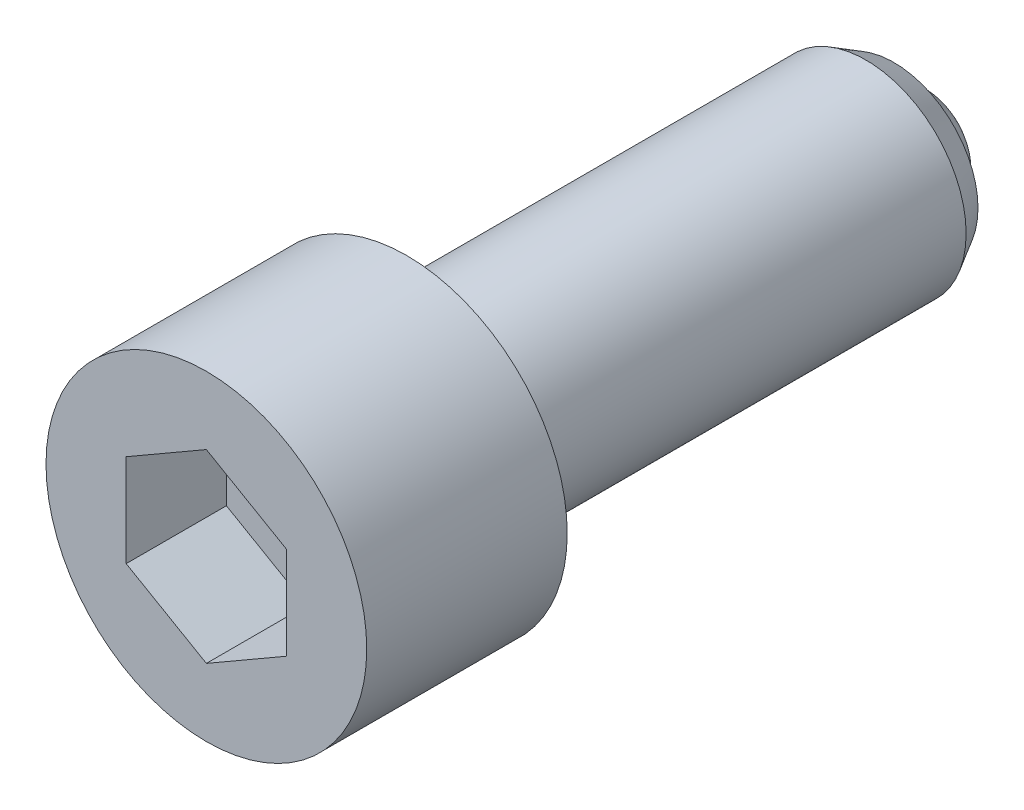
ISO-10303-21;
HEADER;
FILE_DESCRIPTION(('STEP AP214'),'2;1');
FILE_NAME('part.step','',(''),(''),'','','');
FILE_SCHEMA(('AUTOMOTIVE_DESIGN { 1 0 10303 214 1 1 1 1 }'));
ENDSEC;
DATA;
#1=APPLICATION_CONTEXT('core data for automotive mechanical design processes');
#2=APPLICATION_PROTOCOL_DEFINITION('international standard','automotive_design',2000,#1);
#3=PRODUCT_CONTEXT('',#1,'mechanical');
#4=PRODUCT('Part','Part','',(#3));
#5=PRODUCT_RELATED_PRODUCT_CATEGORY('part','',(#4));
#6=PRODUCT_DEFINITION_FORMATION('','',#4);
#7=PRODUCT_DEFINITION_CONTEXT('part definition',#1,'design');
#8=PRODUCT_DEFINITION('design','',#6,#7);
#9=PRODUCT_DEFINITION_SHAPE('','',#8);
#10=(LENGTH_UNIT() NAMED_UNIT(*) SI_UNIT(.MILLI.,.METRE.));
#11=(NAMED_UNIT(*) PLANE_ANGLE_UNIT() SI_UNIT($,.RADIAN.));
#12=(NAMED_UNIT(*) SI_UNIT($,.STERADIAN.) SOLID_ANGLE_UNIT());
#13=UNCERTAINTY_MEASURE_WITH_UNIT(LENGTH_MEASURE(1.E-05),#10,'distance_accuracy_value','');
#14=(GEOMETRIC_REPRESENTATION_CONTEXT(3) GLOBAL_UNCERTAINTY_ASSIGNED_CONTEXT((#13)) GLOBAL_UNIT_ASSIGNED_CONTEXT((#10,
#11,#12)) REPRESENTATION_CONTEXT('',''));
#15=CARTESIAN_POINT('',(0.,0.,0.));
#16=DIRECTION('',(0.,0.,1.));
#17=DIRECTION('',(1.,0.,0.));
#18=AXIS2_PLACEMENT_3D('',#15,#16,#17);
#19=CARTESIAN_POINT('',(0.,0.,3.5));
#20=DIRECTION('',(0.,0.,-1.));
#21=DIRECTION('',(1.,0.,0.));
#22=AXIS2_PLACEMENT_3D('',#19,#20,#21);
#23=SPHERICAL_SURFACE('',#22,3.5);
#24=CARTESIAN_POINT('',(0.,0.,2.4));
#25=DIRECTION('',(0.,0.,-1.));
#26=DIRECTION('',(1.,0.,0.));
#27=AXIS2_PLACEMENT_3D('',#24,#25,#26);
#28=CIRCLE('',#27,3.32264954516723);
#29=CARTESIAN_POINT('',(3.32264954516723,0.,2.4));
#30=VERTEX_POINT('',#29);
#31=EDGE_CURVE('E9',#30,#30,#28,.T.);
#32=ORIENTED_EDGE('',*,*,#31,.T.);
#33=EDGE_LOOP('',(#32));
#34=FACE_BOUND('',#33,.T.);
#35=ADVANCED_FACE('F15',(#34),#23,.T.);
#36=CARTESIAN_POINT('',(4.19170962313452,0.,2.4));
#37=DIRECTION('',(0.,0.,1.));
#38=DIRECTION('',(-1.,0.,0.));
#39=AXIS2_PLACEMENT_3D('',#36,#37,#38);
#40=PLANE('',#39);
#41=ORIENTED_EDGE('',*,*,#31,.F.);
#42=EDGE_LOOP('',(#41));
#43=FACE_BOUND('',#42,.T.);
#44=CARTESIAN_POINT('',(0.,0.,2.4));
#45=DIRECTION('',(0.,0.,-1.));
#46=DIRECTION('',(1.,0.,0.));
#47=AXIS2_PLACEMENT_3D('',#44,#45,#46);
#48=CIRCLE('',#47,4.19170962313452);
#49=CARTESIAN_POINT('',(4.19170962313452,0.,2.4));
#50=VERTEX_POINT('',#49);
#51=EDGE_CURVE('E22',#50,#50,#48,.T.);
#52=ORIENTED_EDGE('',*,*,#51,.T.);
#53=EDGE_LOOP('',(#52));
#54=FACE_BOUND('',#53,.T.);
#55=ADVANCED_FACE('F136',(#43,#54),#40,.F.);
#56=CARTESIAN_POINT('',(0.,0.,3.8));
#57=DIRECTION('',(0.,0.,1.));
#58=DIRECTION('',(-1.,0.,0.));
#59=AXIS2_PLACEMENT_3D('',#56,#57,#58);
#60=CONICAL_SURFACE('',#59,5.,0.523598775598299);
#61=ORIENTED_EDGE('',*,*,#51,.F.);
#62=EDGE_LOOP('',(#61));
#63=FACE_BOUND('',#62,.T.);
#64=CARTESIAN_POINT('',(0.,0.,3.8));
#65=DIRECTION('',(0.,0.,-1.));
#66=DIRECTION('',(1.,0.,0.));
#67=AXIS2_PLACEMENT_3D('',#64,#65,#66);
#68=CIRCLE('',#67,5.);
#69=CARTESIAN_POINT('',(5.,0.,3.8));
#70=VERTEX_POINT('',#69);
#71=EDGE_CURVE('E131',#70,#70,#68,.T.);
#72=ORIENTED_EDGE('',*,*,#71,.T.);
#73=EDGE_LOOP('',(#72));
#74=FACE_BOUND('',#73,.T.);
#75=ADVANCED_FACE('F138',(#63,#74),#60,.T.);
#76=CARTESIAN_POINT('',(0.,0.,-13.3));
#77=DIRECTION('',(0.,0.,-1.));
#78=DIRECTION('',(1.,0.,0.));
#79=AXIS2_PLACEMENT_3D('',#76,#77,#78);
#80=CYLINDRICAL_SURFACE('',#79,5.);
#81=ORIENTED_EDGE('',*,*,#71,.F.);
#82=EDGE_LOOP('',(#81));
#83=FACE_BOUND('',#82,.T.);
#84=CARTESIAN_POINT('',(0.,0.,26.7));
#85=DIRECTION('',(0.,0.,-1.));
#86=DIRECTION('',(1.,0.,0.));
#87=AXIS2_PLACEMENT_3D('',#84,#85,#86);
#88=CIRCLE('',#87,5.);
#89=CARTESIAN_POINT('',(5.,0.,26.7));
#90=VERTEX_POINT('',#89);
#91=EDGE_CURVE('E128',#90,#90,#88,.T.);
#92=ORIENTED_EDGE('',*,*,#91,.T.);
#93=EDGE_LOOP('',(#92));
#94=FACE_BOUND('',#93,.T.);
#95=ADVANCED_FACE('F141',(#83,#94),#80,.T.);
#96=CARTESIAN_POINT('',(5.,0.,26.7));
#97=DIRECTION('',(0.,0.,-1.));
#98=DIRECTION('',(1.,0.,0.));
#99=AXIS2_PLACEMENT_3D('',#96,#97,#98);
#100=PLANE('',#99);
#101=CARTESIAN_POINT('',(0.,0.,26.7));
#102=DIRECTION('',(0.,0.,-1.));
#103=DIRECTION('',(1.,0.,0.));
#104=AXIS2_PLACEMENT_3D('',#101,#102,#103);
#105=CIRCLE('',#104,8.);
#106=CARTESIAN_POINT('',(8.,0.,26.7));
#107=VERTEX_POINT('',#106);
#108=EDGE_CURVE('E125',#107,#107,#105,.T.);
#109=ORIENTED_EDGE('',*,*,#108,.T.);
#110=EDGE_LOOP('',(#109));
#111=FACE_BOUND('',#110,.T.);
#112=ORIENTED_EDGE('',*,*,#91,.F.);
#113=EDGE_LOOP('',(#112));
#114=FACE_BOUND('',#113,.T.);
#115=ADVANCED_FACE('F147',(#111,#114),#100,.T.);
#116=CARTESIAN_POINT('',(0.,0.,-13.3));
#117=DIRECTION('',(0.,0.,-1.));
#118=DIRECTION('',(1.,0.,0.));
#119=AXIS2_PLACEMENT_3D('',#116,#117,#118);
#120=CYLINDRICAL_SURFACE('',#119,8.);
#121=CARTESIAN_POINT('',(0.,0.,36.7));
#122=DIRECTION('',(0.,0.,-1.));
#123=DIRECTION('',(1.,0.,0.));
#124=AXIS2_PLACEMENT_3D('',#121,#122,#123);
#125=CIRCLE('',#124,8.);
#126=CARTESIAN_POINT('',(8.,0.,36.7));
#127=VERTEX_POINT('',#126);
#128=EDGE_CURVE('E122',#127,#127,#125,.T.);
#129=ORIENTED_EDGE('',*,*,#128,.T.);
#130=EDGE_LOOP('',(#129));
#131=FACE_BOUND('',#130,.T.);
#132=ORIENTED_EDGE('',*,*,#108,.F.);
#133=EDGE_LOOP('',(#132));
#134=FACE_BOUND('',#133,.T.);
#135=ADVANCED_FACE('F152',(#131,#134),#120,.T.);
#136=CARTESIAN_POINT('',(8.,0.,36.7));
#137=DIRECTION('',(0.,0.,1.));
#138=DIRECTION('',(-1.,0.,0.));
#139=AXIS2_PLACEMENT_3D('',#136,#137,#138);
#140=PLANE('',#139);
#141=DIRECTION('',(-0.86602540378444,0.5,0.));
#142=VECTOR('',#141,1.);
#143=CARTESIAN_POINT('',(4.,2.30940107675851,36.7));
#144=LINE('',#143,#142);
#145=CARTESIAN_POINT('',(4.,2.30940107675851,36.7));
#146=VERTEX_POINT('',#145);
#147=CARTESIAN_POINT('',(0.,4.618802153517,36.7));
#148=VERTEX_POINT('',#147);
#149=EDGE_CURVE('E29',#146,#148,#144,.T.);
#150=ORIENTED_EDGE('',*,*,#149,.F.);
#151=DIRECTION('',(0.,1.,0.));
#152=VECTOR('',#151,1.);
#153=CARTESIAN_POINT('',(4.,-2.30940107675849,36.7));
#154=LINE('',#153,#152);
#155=CARTESIAN_POINT('',(4.,-2.30940107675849,36.7));
#156=VERTEX_POINT('',#155);
#157=EDGE_CURVE('E98',#156,#146,#154,.T.);
#158=ORIENTED_EDGE('',*,*,#157,.F.);
#159=DIRECTION('',(-0.866025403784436,-0.5,0.));
#160=VECTOR('',#159,1.);
#161=CARTESIAN_POINT('',(4.,-2.30940107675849,36.7));
#162=LINE('',#161,#160);
#163=CARTESIAN_POINT('',(0.,-4.61880215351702,36.7));
#164=VERTEX_POINT('',#163);
#165=EDGE_CURVE('E93',#156,#164,#162,.T.);
#166=ORIENTED_EDGE('',*,*,#165,.T.);
#167=DIRECTION('',(0.866025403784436,-0.5,0.));
#168=VECTOR('',#167,1.);
#169=CARTESIAN_POINT('',(-4.,-2.30940107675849,36.7));
#170=LINE('',#169,#168);
#171=CARTESIAN_POINT('',(-4.,-2.30940107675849,36.7));
#172=VERTEX_POINT('',#171);
#173=EDGE_CURVE('E91',#172,#164,#170,.T.);
#174=ORIENTED_EDGE('',*,*,#173,.F.);
#175=DIRECTION('',(0.,1.,0.));
#176=VECTOR('',#175,1.);
#177=CARTESIAN_POINT('',(-4.,-2.30940107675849,36.7));
#178=LINE('',#177,#176);
#179=CARTESIAN_POINT('',(-4.,2.30940107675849,36.7));
#180=VERTEX_POINT('',#179);
#181=EDGE_CURVE('E72',#172,#180,#178,.T.);
#182=ORIENTED_EDGE('',*,*,#181,.T.);
#183=DIRECTION('',(0.866025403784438,0.5,0.));
#184=VECTOR('',#183,1.);
#185=CARTESIAN_POINT('',(-4.,2.30940107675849,36.7));
#186=LINE('',#185,#184);
#187=EDGE_CURVE('E83',#180,#148,#186,.T.);
#188=ORIENTED_EDGE('',*,*,#187,.T.);
#189=EDGE_LOOP('',(#150,#158,#166,#174,#182,#188));
#190=FACE_BOUND('',#189,.T.);
#191=ORIENTED_EDGE('',*,*,#128,.F.);
#192=EDGE_LOOP('',(#191));
#193=FACE_BOUND('',#192,.T.);
#194=ADVANCED_FACE('F87',(#190,#193),#140,.T.);
#195=CARTESIAN_POINT('',(4.,2.30940107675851,31.7));
#196=DIRECTION('',(0.5,0.86602540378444,0.));
#197=DIRECTION('',(0.86602540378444,-0.5,0.));
#198=AXIS2_PLACEMENT_3D('',#195,#196,#197);
#199=PLANE('',#198);
#200=DIRECTION('',(0.,0.,1.));
#201=VECTOR('',#200,1.);
#202=CARTESIAN_POINT('',(4.,2.30940107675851,31.7));
#203=LINE('',#202,#201);
#204=CARTESIAN_POINT('',(4.,2.30940107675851,31.7));
#205=VERTEX_POINT('',#204);
#206=EDGE_CURVE('E36',#205,#146,#203,.T.);
#207=ORIENTED_EDGE('',*,*,#206,.T.);
#208=ORIENTED_EDGE('',*,*,#149,.T.);
#209=DIRECTION('',(0.,0.,1.));
#210=VECTOR('',#209,1.);
#211=CARTESIAN_POINT('',(0.,4.618802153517,31.7));
#212=LINE('',#211,#210);
#213=CARTESIAN_POINT('',(0.,4.618802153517,31.7));
#214=VERTEX_POINT('',#213);
#215=EDGE_CURVE('E80',#214,#148,#212,.T.);
#216=ORIENTED_EDGE('',*,*,#215,.F.);
#217=DIRECTION('',(-0.86602540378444,0.5,0.));
#218=VECTOR('',#217,1.);
#219=CARTESIAN_POINT('',(4.,2.30940107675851,31.7));
#220=LINE('',#219,#218);
#221=EDGE_CURVE('E100',#205,#214,#220,.T.);
#222=ORIENTED_EDGE('',*,*,#221,.F.);
#223=EDGE_LOOP('',(#207,#208,#216,#222));
#224=FACE_BOUND('',#223,.T.);
#225=ADVANCED_FACE('F206',(#224),#199,.F.);
#226=CARTESIAN_POINT('',(4.,-2.30940107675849,31.7));
#227=DIRECTION('',(1.,0.,0.));
#228=DIRECTION('',(0.,-1.,0.));
#229=AXIS2_PLACEMENT_3D('',#226,#227,#228);
#230=PLANE('',#229);
#231=DIRECTION('',(0.,0.,1.));
#232=VECTOR('',#231,1.);
#233=CARTESIAN_POINT('',(4.,-2.30940107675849,31.7));
#234=LINE('',#233,#232);
#235=CARTESIAN_POINT('',(4.,-2.30940107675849,31.7));
#236=VERTEX_POINT('',#235);
#237=EDGE_CURVE('E119',#236,#156,#234,.T.);
#238=ORIENTED_EDGE('',*,*,#237,.T.);
#239=ORIENTED_EDGE('',*,*,#157,.T.);
#240=ORIENTED_EDGE('',*,*,#206,.F.);
#241=DIRECTION('',(0.,1.,0.));
#242=VECTOR('',#241,1.);
#243=CARTESIAN_POINT('',(4.,-2.30940107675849,31.7));
#244=LINE('',#243,#242);
#245=EDGE_CURVE('E112',#236,#205,#244,.T.);
#246=ORIENTED_EDGE('',*,*,#245,.F.);
#247=EDGE_LOOP('',(#238,#239,#240,#246));
#248=FACE_BOUND('',#247,.T.);
#249=ADVANCED_FACE('F215',(#248),#230,.F.);
#250=CARTESIAN_POINT('',(4.,-2.30940107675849,31.7));
#251=DIRECTION('',(-0.5,0.866025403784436,0.));
#252=DIRECTION('',(0.866025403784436,0.5,0.));
#253=AXIS2_PLACEMENT_3D('',#250,#251,#252);
#254=PLANE('',#253);
#255=DIRECTION('',(0.,0.,1.));
#256=VECTOR('',#255,1.);
#257=CARTESIAN_POINT('',(0.,-4.61880215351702,31.7));
#258=LINE('',#257,#256);
#259=CARTESIAN_POINT('',(0.,-4.61880215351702,31.7));
#260=VERTEX_POINT('',#259);
#261=EDGE_CURVE('E117',#260,#164,#258,.T.);
#262=ORIENTED_EDGE('',*,*,#261,.T.);
#263=ORIENTED_EDGE('',*,*,#165,.F.);
#264=ORIENTED_EDGE('',*,*,#237,.F.);
#265=DIRECTION('',(-0.866025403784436,-0.5,0.));
#266=VECTOR('',#265,1.);
#267=CARTESIAN_POINT('',(4.,-2.30940107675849,31.7));
#268=LINE('',#267,#266);
#269=EDGE_CURVE('E109',#236,#260,#268,.T.);
#270=ORIENTED_EDGE('',*,*,#269,.T.);
#271=EDGE_LOOP('',(#262,#263,#264,#270));
#272=FACE_BOUND('',#271,.T.);
#273=ADVANCED_FACE('F224',(#272),#254,.T.);
#274=CARTESIAN_POINT('',(-4.,-2.30940107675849,31.7));
#275=DIRECTION('',(-0.5,-0.866025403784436,0.));
#276=DIRECTION('',(-0.866025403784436,0.5,0.));
#277=AXIS2_PLACEMENT_3D('',#274,#275,#276);
#278=PLANE('',#277);
#279=DIRECTION('',(0.,0.,1.));
#280=VECTOR('',#279,1.);
#281=CARTESIAN_POINT('',(-4.,-2.30940107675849,31.7));
#282=LINE('',#281,#280);
#283=CARTESIAN_POINT('',(-4.,-2.30940107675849,31.7));
#284=VERTEX_POINT('',#283);
#285=EDGE_CURVE('E79',#284,#172,#282,.T.);
#286=ORIENTED_EDGE('',*,*,#285,.T.);
#287=ORIENTED_EDGE('',*,*,#173,.T.);
#288=ORIENTED_EDGE('',*,*,#261,.F.);
#289=DIRECTION('',(0.866025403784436,-0.5,0.));
#290=VECTOR('',#289,1.);
#291=CARTESIAN_POINT('',(-4.,-2.30940107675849,31.7));
#292=LINE('',#291,#290);
#293=EDGE_CURVE('E106',#284,#260,#292,.T.);
#294=ORIENTED_EDGE('',*,*,#293,.F.);
#295=EDGE_LOOP('',(#286,#287,#288,#294));
#296=FACE_BOUND('',#295,.T.);
#297=ADVANCED_FACE('F233',(#296),#278,.F.);
#298=CARTESIAN_POINT('',(-4.,-2.30940107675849,31.7));
#299=DIRECTION('',(1.,0.,0.));
#300=DIRECTION('',(0.,-1.,0.));
#301=AXIS2_PLACEMENT_3D('',#298,#299,#300);
#302=PLANE('',#301);
#303=DIRECTION('',(0.,0.,1.));
#304=VECTOR('',#303,1.);
#305=CARTESIAN_POINT('',(-4.,2.30940107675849,31.7));
#306=LINE('',#305,#304);
#307=CARTESIAN_POINT('',(-4.,2.30940107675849,31.7));
#308=VERTEX_POINT('',#307);
#309=EDGE_CURVE('E68',#308,#180,#306,.T.);
#310=ORIENTED_EDGE('',*,*,#309,.T.);
#311=ORIENTED_EDGE('',*,*,#181,.F.);
#312=ORIENTED_EDGE('',*,*,#285,.F.);
#313=DIRECTION('',(0.,1.,0.));
#314=VECTOR('',#313,1.);
#315=CARTESIAN_POINT('',(-4.,-2.30940107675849,31.7));
#316=LINE('',#315,#314);
#317=EDGE_CURVE('E75',#284,#308,#316,.T.);
#318=ORIENTED_EDGE('',*,*,#317,.T.);
#319=EDGE_LOOP('',(#310,#311,#312,#318));
#320=FACE_BOUND('',#319,.T.);
#321=ADVANCED_FACE('F70',(#320),#302,.T.);
#322=CARTESIAN_POINT('',(-4.,2.30940107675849,31.7));
#323=DIRECTION('',(0.5,-0.866025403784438,0.));
#324=DIRECTION('',(-0.866025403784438,-0.5,0.));
#325=AXIS2_PLACEMENT_3D('',#322,#323,#324);
#326=PLANE('',#325);
#327=DIRECTION('',(0.866025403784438,0.5,0.));
#328=VECTOR('',#327,1.);
#329=CARTESIAN_POINT('',(-4.,2.30940107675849,31.7));
#330=LINE('',#329,#328);
#331=EDGE_CURVE('E103',#308,#214,#330,.T.);
#332=ORIENTED_EDGE('',*,*,#331,.T.);
#333=ORIENTED_EDGE('',*,*,#215,.T.);
#334=ORIENTED_EDGE('',*,*,#187,.F.);
#335=ORIENTED_EDGE('',*,*,#309,.F.);
#336=EDGE_LOOP('',(#332,#333,#334,#335));
#337=FACE_BOUND('',#336,.T.);
#338=ADVANCED_FACE('F84',(#337),#326,.T.);
#339=CARTESIAN_POINT('',(8.,0.,31.7));
#340=DIRECTION('',(0.,0.,1.));
#341=DIRECTION('',(-1.,0.,0.));
#342=AXIS2_PLACEMENT_3D('',#339,#340,#341);
#343=PLANE('',#342);
#344=ORIENTED_EDGE('',*,*,#221,.T.);
#345=ORIENTED_EDGE('',*,*,#331,.F.);
#346=ORIENTED_EDGE('',*,*,#317,.F.);
#347=ORIENTED_EDGE('',*,*,#293,.T.);
#348=ORIENTED_EDGE('',*,*,#269,.F.);
#349=ORIENTED_EDGE('',*,*,#245,.T.);
#350=EDGE_LOOP('',(#344,#345,#346,#347,#348,#349));
#351=FACE_BOUND('',#350,.T.);
#352=ADVANCED_FACE('F253',(#351),#343,.T.);
#353=CLOSED_SHELL('',(#35,#55,#75,#95,#115,#135,#194,#225,#249,#273,#297,#321,#338,#352));
#354=MANIFOLD_SOLID_BREP('B1',#353);
#355=ADVANCED_BREP_SHAPE_REPRESENTATION('',(#18,#354),#14);
#356=SHAPE_DEFINITION_REPRESENTATION(#9,#355);
ENDSEC;
END-ISO-10303-21;
